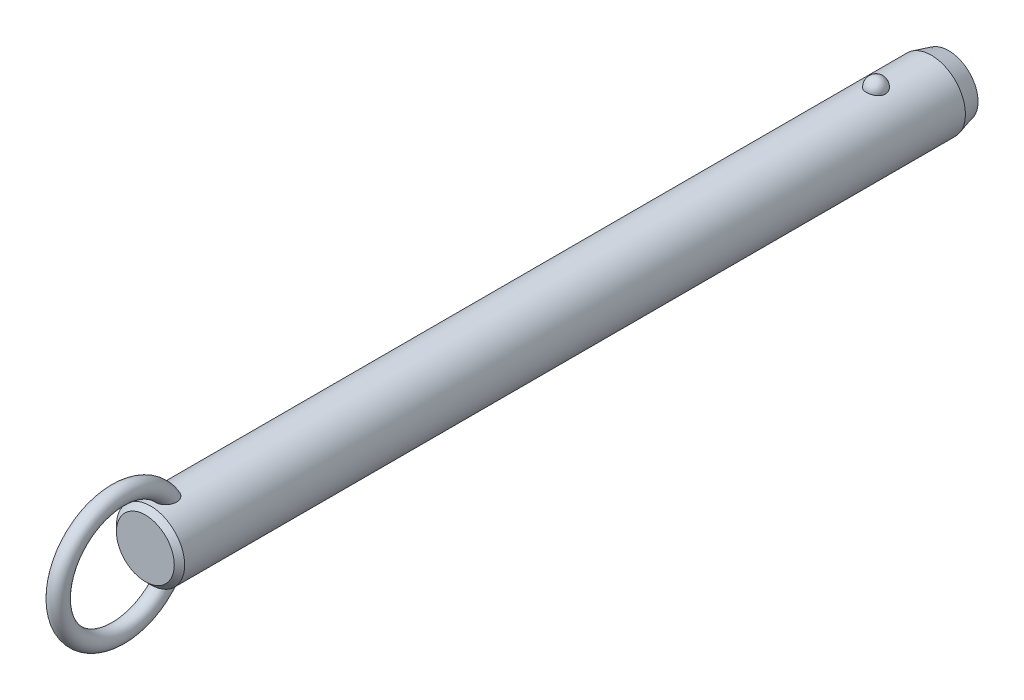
ISO-10303-21;
HEADER;
FILE_DESCRIPTION(('STEP AP214'),'2;1');
FILE_NAME('part.step','',(''),(''),'','','');
FILE_SCHEMA(('AUTOMOTIVE_DESIGN { 1 0 10303 214 1 1 1 1 }'));
ENDSEC;
DATA;
#1=APPLICATION_CONTEXT('core data for automotive mechanical design processes');
#2=APPLICATION_PROTOCOL_DEFINITION('international standard','automotive_design',2000,#1);
#3=PRODUCT_CONTEXT('',#1,'mechanical');
#4=PRODUCT('Part','Part','',(#3));
#5=PRODUCT_RELATED_PRODUCT_CATEGORY('part','',(#4));
#6=PRODUCT_DEFINITION_FORMATION('','',#4);
#7=PRODUCT_DEFINITION_CONTEXT('part definition',#1,'design');
#8=PRODUCT_DEFINITION('design','',#6,#7);
#9=PRODUCT_DEFINITION_SHAPE('','',#8);
#10=(LENGTH_UNIT() NAMED_UNIT(*) SI_UNIT(.MILLI.,.METRE.));
#11=(NAMED_UNIT(*) PLANE_ANGLE_UNIT() SI_UNIT($,.RADIAN.));
#12=(NAMED_UNIT(*) SI_UNIT($,.STERADIAN.) SOLID_ANGLE_UNIT());
#13=UNCERTAINTY_MEASURE_WITH_UNIT(LENGTH_MEASURE(1.E-05),#10,'distance_accuracy_value','');
#14=(GEOMETRIC_REPRESENTATION_CONTEXT(3) GLOBAL_UNCERTAINTY_ASSIGNED_CONTEXT((#13)) GLOBAL_UNIT_ASSIGNED_CONTEXT((#10,
#11,#12)) REPRESENTATION_CONTEXT('',''));
#15=CARTESIAN_POINT('',(0.,0.,0.));
#16=DIRECTION('',(0.,0.,1.));
#17=DIRECTION('',(1.,0.,0.));
#18=AXIS2_PLACEMENT_3D('',#15,#16,#17);
#19=CARTESIAN_POINT('',(0.,0.,157.5));
#20=DIRECTION('',(0.,0.,-1.));
#21=DIRECTION('',(-1.,0.,0.));
#22=AXIS2_PLACEMENT_3D('',#19,#20,#21);
#23=CYLINDRICAL_SURFACE('',#22,7.9);
#24=CARTESIAN_POINT('',(2.1785689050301,7.59367088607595,-2.20000000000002));
#25=CARTESIAN_POINT('',(2.17856679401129,7.59367269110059,-2.07701843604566));
#26=CARTESIAN_POINT('',(2.16853481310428,7.59657145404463,-1.95401006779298));
#27=CARTESIAN_POINT('',(2.12864689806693,7.607843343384,-1.71147811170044));
#28=CARTESIAN_POINT('',(2.09878338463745,7.61621856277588,-1.5919558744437));
#29=CARTESIAN_POINT('',(2.0199931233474,7.63749180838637,-1.35985638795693));
#30=CARTESIAN_POINT('',(1.97107475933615,7.6503878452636,-1.24727610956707));
#31=CARTESIAN_POINT('',(1.85539377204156,7.67926115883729,-1.03213234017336));
#32=CARTESIAN_POINT('',(1.78863158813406,7.69523835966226,-0.929568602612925));
#33=CARTESIAN_POINT('',(1.63856494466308,7.7285848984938,-0.73678633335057));
#34=CARTESIAN_POINT('',(1.55518140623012,7.7459606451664,-0.646630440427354));
#35=CARTESIAN_POINT('',(1.37422937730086,7.78009978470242,-0.481747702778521));
#36=CARTESIAN_POINT('',(1.27666086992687,7.79686317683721,-0.407020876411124));
#37=CARTESIAN_POINT('',(1.07024728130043,7.82786153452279,-0.275278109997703));
#38=CARTESIAN_POINT('',(0.961434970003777,7.84210353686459,-0.218212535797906));
#39=CARTESIAN_POINT('',(0.735351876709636,7.86652194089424,-0.123146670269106));
#40=CARTESIAN_POINT('',(0.618082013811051,7.87669878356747,-0.0851443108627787));
#41=CARTESIAN_POINT('',(0.380637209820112,7.89170521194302,-0.0298158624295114));
#42=CARTESIAN_POINT('',(0.260550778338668,7.89662650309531,-0.0121347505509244));
#43=CARTESIAN_POINT('',(0.0190117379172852,7.90090003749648,0.00324379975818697));
#44=CARTESIAN_POINT('',(-0.102440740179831,7.90025280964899,0.000943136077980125));
#45=CARTESIAN_POINT('',(-0.341452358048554,7.89351056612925,-0.0233955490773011));
#46=CARTESIAN_POINT('',(-0.459042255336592,7.88749257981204,-0.0451545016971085));
#47=CARTESIAN_POINT('',(-0.688796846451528,7.87075812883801,-0.107408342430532));
#48=CARTESIAN_POINT('',(-0.800961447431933,7.86004158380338,-0.14790355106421));
#49=CARTESIAN_POINT('',(-1.01743634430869,7.83497131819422,-0.246799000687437));
#50=CARTESIAN_POINT('',(-1.12169791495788,7.82059709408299,-0.305300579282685));
#51=CARTESIAN_POINT('',(-1.31891765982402,7.78976470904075,-0.43854939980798));
#52=CARTESIAN_POINT('',(-1.41187469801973,7.77330633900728,-0.513298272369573));
#53=CARTESIAN_POINT('',(-1.58577142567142,7.73972434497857,-0.678622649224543));
#54=CARTESIAN_POINT('',(-1.66645140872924,7.72259402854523,-0.769470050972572));
#55=CARTESIAN_POINT('',(-1.81161503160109,7.68983776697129,-0.963538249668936));
#56=CARTESIAN_POINT('',(-1.87609753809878,7.6742119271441,-1.0667599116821));
#57=CARTESIAN_POINT('',(-1.98790138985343,7.6460202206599,-1.28401170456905));
#58=CARTESIAN_POINT('',(-2.03501994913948,7.63349104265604,-1.39815107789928));
#59=CARTESIAN_POINT('',(-2.10986724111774,7.6131449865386,-1.6330178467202));
#60=CARTESIAN_POINT('',(-2.1375965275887,7.60532797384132,-1.75374505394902));
#61=CARTESIAN_POINT('',(-2.17289256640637,7.5953195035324,-1.99782562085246));
#62=CARTESIAN_POINT('',(-2.18054294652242,7.59310471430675,-2.12116592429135));
#63=CARTESIAN_POINT('',(-2.17572919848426,7.59448538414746,-2.36741799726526));
#64=CARTESIAN_POINT('',(-2.1632656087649,7.59808068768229,-2.49032977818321));
#65=CARTESIAN_POINT('',(-2.11865035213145,7.61064035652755,-2.73161015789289));
#66=CARTESIAN_POINT('',(-2.08659579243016,7.61957823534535,-2.84999812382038));
#67=CARTESIAN_POINT('',(-2.00367799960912,7.64179982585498,-3.07955956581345));
#68=CARTESIAN_POINT('',(-1.9528140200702,7.65508371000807,-3.19073275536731));
#69=CARTESIAN_POINT('',(-1.83321113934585,7.68460381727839,-3.40337899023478));
#70=CARTESIAN_POINT('',(-1.76437735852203,7.70085556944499,-3.5047965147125));
#71=CARTESIAN_POINT('',(-1.61069526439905,7.73445734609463,-3.69446912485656));
#72=CARTESIAN_POINT('',(-1.52584634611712,7.75180741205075,-3.78272371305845));
#73=CARTESIAN_POINT('',(-1.34198059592,7.78574608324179,-3.94393987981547));
#74=CARTESIAN_POINT('',(-1.24291308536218,7.80233167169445,-4.01684434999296));
#75=CARTESIAN_POINT('',(-1.03352039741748,7.83281625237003,-4.14489386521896));
#76=CARTESIAN_POINT('',(-0.92319600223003,7.84671543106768,-4.20004014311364));
#77=CARTESIAN_POINT('',(-0.695822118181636,7.87011575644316,-4.29042017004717));
#78=CARTESIAN_POINT('',(-0.578872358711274,7.87966903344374,-4.32589112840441));
#79=CARTESIAN_POINT('',(-0.340410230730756,7.8935652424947,-4.37692226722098));
#80=CARTESIAN_POINT('',(-0.218898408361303,7.89790879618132,-4.39248482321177));
#81=CARTESIAN_POINT('',(0.0228107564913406,7.90087453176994,-4.40314405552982));
#82=CARTESIAN_POINT('',(0.142990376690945,7.89960185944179,-4.39861683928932));
#83=CARTESIAN_POINT('',(0.380829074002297,7.89171262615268,-4.37008293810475));
#84=CARTESIAN_POINT('',(0.498488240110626,7.8850962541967,-4.34607694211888));
#85=CARTESIAN_POINT('',(0.727535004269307,7.86726442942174,-4.27939317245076));
#86=CARTESIAN_POINT('',(0.838944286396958,7.85606616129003,-4.23678512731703));
#87=CARTESIAN_POINT('',(1.05295421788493,7.83025654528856,-4.13408348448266));
#88=CARTESIAN_POINT('',(1.15555431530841,7.81564498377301,-4.07398879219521));
#89=CARTESIAN_POINT('',(1.35076763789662,7.7843022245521,-3.93687432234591));
#90=CARTESIAN_POINT('',(1.4432046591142,7.76754209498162,-3.85961036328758));
#91=CARTESIAN_POINT('',(1.6139111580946,7.73387857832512,-3.69076949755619));
#92=CARTESIAN_POINT('',(1.6921781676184,7.71697516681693,-3.59919010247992));
#93=CARTESIAN_POINT('',(1.83380875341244,7.6845643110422,-3.40247278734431));
#94=CARTESIAN_POINT('',(1.89689280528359,7.66908588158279,-3.29712873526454));
#95=CARTESIAN_POINT('',(2.0047823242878,7.64159441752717,-3.07707931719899));
#96=CARTESIAN_POINT('',(2.0495945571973,7.62958010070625,-2.96237743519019));
#97=CARTESIAN_POINT('',(2.11580183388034,7.61146617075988,-2.74040519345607));
#98=CARTESIAN_POINT('',(2.13929812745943,7.60484503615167,-2.63379846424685));
#99=CARTESIAN_POINT('',(2.17068242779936,7.59594664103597,-2.4181348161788));
#100=CARTESIAN_POINT('',(2.17857077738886,7.59366928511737,-2.30907795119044));
#101=CARTESIAN_POINT('',(2.1785689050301,7.59367088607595,-2.20000000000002));
#102=B_SPLINE_CURVE_WITH_KNOTS('',3,(#24,#25,#26,#27,#28,#29,#30,#31,#32,#33,#34,#35,#36,#37,
#38,#39,#40,#41,#42,#43,#44,#45,#46,#47,#48,#49,#50,#51,#52,#53,#54,#55,#56,#57,#58,#59,#60,#61,
#62,#63,#64,#65,#66,#67,#68,#69,#70,#71,#72,#73,#74,#75,#76,#77,#78,#79,#80,#81,#82,#83,#84,#85,
#86,#87,#88,#89,#90,#91,#92,#93,#94,#95,#96,#97,#98,#99,#100,#101),.UNSPECIFIED.,.T.,.F.,(4,2,2,
2,2,2,2,2,2,2,2,2,2,2,2,2,2,2,2,2,2,2,2,2,2,2,2,2,2,2,2,2,2,2,2,2,2,2,4),(0.,0.368552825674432,
0.737246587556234,1.10577831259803,1.4743009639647,1.8446206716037,2.21494081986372,
2.5842105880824,2.95344028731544,3.31611630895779,3.67875788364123,4.03628044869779,
4.39380913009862,4.75338791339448,5.11300280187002,5.47939989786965,5.8458226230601,
6.21639834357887,6.58696347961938,6.95598276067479,7.32499216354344,7.69218715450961,
8.0593967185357,8.42858578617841,8.79778880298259,9.16834203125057,9.5388695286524,
9.90482699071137,10.2707407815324,10.6298333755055,10.9889132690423,11.3466585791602,
11.7044262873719,12.0676511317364,12.4309391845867,12.8004764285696,13.1698767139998,
13.4967701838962,13.8236564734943),.UNSPECIFIED.);
#103=CARTESIAN_POINT('',(2.1785689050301,7.59367088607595,-2.20000000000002));
#104=VERTEX_POINT('',#103);
#105=EDGE_CURVE('E41',#104,#104,#102,.T.);
#106=ORIENTED_EDGE('',*,*,#105,.T.);
#107=EDGE_LOOP('',(#106));
#108=FACE_BOUND('',#107,.T.);
#109=CARTESIAN_POINT('',(0.,0.,165.82));
#110=DIRECTION('',(0.,0.,1.));
#111=DIRECTION('',(1.,0.,0.));
#112=AXIS2_PLACEMENT_3D('',#109,#110,#111);
#113=CIRCLE('',#112,7.9);
#114=CARTESIAN_POINT('',(7.9,0.,165.82));
#115=VERTEX_POINT('',#114);
#116=EDGE_CURVE('E10',#115,#115,#113,.F.);
#117=ORIENTED_EDGE('',*,*,#116,.T.);
#118=EDGE_LOOP('',(#117));
#119=FACE_BOUND('',#118,.T.);
#120=CARTESIAN_POINT('',(-0.630969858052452,-7.87476203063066,159.712432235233));
#121=CARTESIAN_POINT('',(-0.734180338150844,-7.86648998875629,159.747285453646));
#122=CARTESIAN_POINT('',(-0.834476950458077,-7.85639291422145,159.790816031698));
#123=CARTESIAN_POINT('',(-1.0262035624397,-7.83366343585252,159.894094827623));
#124=CARTESIAN_POINT('',(-1.1176141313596,-7.82102565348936,159.953877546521));
#125=CARTESIAN_POINT('',(-1.28877277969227,-7.79464922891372,160.087839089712));
#126=CARTESIAN_POINT('',(-1.36854014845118,-7.78091246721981,160.161993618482));
#127=CARTESIAN_POINT('',(-1.51461521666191,-7.75380398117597,160.322494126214));
#128=CARTESIAN_POINT('',(-1.58092966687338,-7.74043207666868,160.408833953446));
#129=CARTESIAN_POINT('',(-1.70019064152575,-7.7151252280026,160.592978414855));
#130=CARTESIAN_POINT('',(-1.75284037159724,-7.70322473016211,160.690979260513));
#131=CARTESIAN_POINT('',(-1.84263464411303,-7.68224112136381,160.894102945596));
#132=CARTESIAN_POINT('',(-1.87977299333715,-7.6731591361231,160.999228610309));
#133=CARTESIAN_POINT('',(-1.94152728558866,-7.65777930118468,161.223284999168));
#134=CARTESIAN_POINT('',(-1.96475471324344,-7.65179654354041,161.342616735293));
#135=CARTESIAN_POINT('',(-1.99449499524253,-7.64409642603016,161.58342986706));
#136=CARTESIAN_POINT('',(-2.0010005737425,-7.64238092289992,161.704912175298));
#137=CARTESIAN_POINT('',(-1.99856014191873,-7.64302120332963,161.968340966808));
#138=CARTESIAN_POINT('',(-1.98680021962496,-7.64611845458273,162.11025654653));
#139=CARTESIAN_POINT('',(-1.94457772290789,-7.65696186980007,162.391118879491));
#140=CARTESIAN_POINT('',(-1.91409393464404,-7.66471330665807,162.530062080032));
#141=CARTESIAN_POINT('',(-1.82768670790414,-7.68582947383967,162.831939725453));
#142=CARTESIAN_POINT('',(-1.76772963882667,-7.70003779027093,162.993686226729));
#143=CARTESIAN_POINT('',(-1.65998501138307,-7.72371550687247,163.227695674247));
#144=CARTESIAN_POINT('',(-1.621079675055,-7.73200670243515,163.304297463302));
#145=CARTESIAN_POINT('',(-1.53727726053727,-7.74910377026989,163.454079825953));
#146=CARTESIAN_POINT('',(-1.49238215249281,-7.75790947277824,163.527261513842));
#147=CARTESIAN_POINT('',(-1.37397050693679,-7.77993338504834,163.70288382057));
#148=CARTESIAN_POINT('',(-1.29690364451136,-7.79328473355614,163.802955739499));
#149=CARTESIAN_POINT('',(-1.1288548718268,-7.81939266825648,163.990714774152));
#150=CARTESIAN_POINT('',(-1.0378992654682,-7.83215032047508,164.078424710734));
#151=CARTESIAN_POINT('',(-0.86953281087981,-7.85231710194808,164.213414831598));
#152=CARTESIAN_POINT('',(-0.795716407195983,-7.86021093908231,164.265076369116));
#153=CARTESIAN_POINT('',(-0.640813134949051,-7.87434920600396,164.356381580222));
#154=CARTESIAN_POINT('',(-0.559737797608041,-7.88059619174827,164.39604389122));
#155=CARTESIAN_POINT('',(-0.406456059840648,-7.88984116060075,164.454300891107));
#156=CARTESIAN_POINT('',(-0.335227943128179,-7.89321892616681,164.475384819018));
#157=CARTESIAN_POINT('',(-0.190193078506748,-7.89804235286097,164.50541418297));
#158=CARTESIAN_POINT('',(-0.11638863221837,-7.89948969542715,164.514370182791));
#159=CARTESIAN_POINT('',(0.0318414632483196,-7.90028409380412,164.519291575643));
#160=CARTESIAN_POINT('',(0.106268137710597,-7.89962640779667,164.515227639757));
#161=CARTESIAN_POINT('',(0.253290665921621,-7.8962818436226,164.494461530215));
#162=CARTESIAN_POINT('',(0.325885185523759,-7.8935935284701,164.477750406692));
#163=CARTESIAN_POINT('',(0.481441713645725,-7.88577340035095,164.428738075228));
#164=CARTESIAN_POINT('',(0.563611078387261,-7.88026321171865,164.394005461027));
#165=CARTESIAN_POINT('',(0.721129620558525,-7.86741729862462,164.311796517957));
#166=CARTESIAN_POINT('',(0.796466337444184,-7.86007832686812,164.264297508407));
#167=CARTESIAN_POINT('',(0.971456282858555,-7.84073285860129,164.136513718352));
#168=CARTESIAN_POINT('',(1.06719686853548,-7.82809461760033,164.051004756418));
#169=CARTESIAN_POINT('',(1.24418921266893,-7.80192439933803,163.866232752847));
#170=CARTESIAN_POINT('',(1.32540832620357,-7.78839049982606,163.766939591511));
#171=CARTESIAN_POINT('',(1.45199971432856,-7.76559693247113,163.589576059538));
#172=CARTESIAN_POINT('',(1.50085649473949,-7.75626094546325,163.513954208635));
#173=CARTESIAN_POINT('',(1.59197749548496,-7.7380727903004,163.358742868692));
#174=CARTESIAN_POINT('',(1.63423919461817,-7.72922080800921,163.279151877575));
#175=CARTESIAN_POINT('',(1.71222612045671,-7.71231959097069,163.116664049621));
#176=CARTESIAN_POINT('',(1.74794516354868,-7.70427111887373,163.033764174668));
#177=CARTESIAN_POINT('',(1.81270113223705,-7.68929240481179,162.8652967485));
#178=CARTESIAN_POINT('',(1.84173789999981,-7.68236218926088,162.779729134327));
#179=CARTESIAN_POINT('',(1.89322698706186,-7.6698375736,162.60528702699));
#180=CARTESIAN_POINT('',(1.91558744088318,-7.66426199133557,162.516383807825));
#181=CARTESIAN_POINT('',(1.95281367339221,-7.65485915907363,162.336969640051));
#182=CARTESIAN_POINT('',(1.96767946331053,-7.65103190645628,162.246458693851));
#183=CARTESIAN_POINT('',(2.00021456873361,-7.64262981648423,161.973732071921));
#184=CARTESIAN_POINT('',(2.00600691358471,-7.6410871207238,161.789709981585));
#185=CARTESIAN_POINT('',(1.98445334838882,-7.64669564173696,161.476501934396));
#186=CARTESIAN_POINT('',(1.96607186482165,-7.65149688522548,161.346618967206));
#187=CARTESIAN_POINT('',(1.90884967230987,-7.6659762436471,161.091632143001));
#188=CARTESIAN_POINT('',(1.87002101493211,-7.67565148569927,160.966525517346));
#189=CARTESIAN_POINT('',(1.77063986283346,-7.69918471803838,160.72454013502));
#190=CARTESIAN_POINT('',(1.70993724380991,-7.71307150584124,160.607725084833));
#191=CARTESIAN_POINT('',(1.56733070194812,-7.74330306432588,160.388144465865));
#192=CARTESIAN_POINT('',(1.48543692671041,-7.75964665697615,160.285372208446));
#193=CARTESIAN_POINT('',(1.31346177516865,-7.79047523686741,160.109380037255));
#194=CARTESIAN_POINT('',(1.22547278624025,-7.80495298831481,160.034106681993));
#195=CARTESIAN_POINT('',(1.03724352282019,-7.83218597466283,159.900486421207));
#196=CARTESIAN_POINT('',(0.937008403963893,-7.84494192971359,159.842132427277));
#197=CARTESIAN_POINT('',(0.733599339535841,-7.86649045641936,159.747027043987));
#198=CARTESIAN_POINT('',(0.630941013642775,-7.87547134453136,159.709210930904));
#199=CARTESIAN_POINT('',(0.420465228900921,-7.88950708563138,159.651116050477));
#200=CARTESIAN_POINT('',(0.312645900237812,-7.89456050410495,159.63084369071));
#201=CARTESIAN_POINT('',(0.0960869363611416,-7.9001518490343,159.608455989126));
#202=CARTESIAN_POINT('',(-0.012634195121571,-7.90073226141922,159.606169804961));
#203=CARTESIAN_POINT('',(-0.228766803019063,-7.89742350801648,159.619367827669));
#204=CARTESIAN_POINT('',(-0.336180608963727,-7.89354403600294,159.634813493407));
#205=CARTESIAN_POINT('',(-0.473410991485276,-7.88586871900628,159.666217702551));
#206=CARTESIAN_POINT('',(-0.505257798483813,-7.88388984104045,159.674354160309));
#207=CARTESIAN_POINT('',(-0.568481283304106,-7.87958326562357,159.692208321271));
#208=CARTESIAN_POINT('',(-0.599857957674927,-7.87725556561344,159.701926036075));
#209=CARTESIAN_POINT('',(-0.630969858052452,-7.87476203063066,159.712432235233));
#210=B_SPLINE_CURVE_WITH_KNOTS('',3,(#120,#121,#122,#123,#124,#125,#126,#127,#128,#129,#130,
#131,#132,#133,#134,#135,#136,#137,#138,#139,#140,#141,#142,#143,#144,#145,#146,#147,#148,#149,
#150,#151,#152,#153,#154,#155,#156,#157,#158,#159,#160,#161,#162,#163,#164,#165,#166,#167,#168,
#169,#170,#171,#172,#173,#174,#175,#176,#177,#178,#179,#180,#181,#182,#183,#184,#185,#186,#187,
#188,#189,#190,#191,#192,#193,#194,#195,#196,#197,#198,#199,#200,#201,#202,#203,#204,#205,#206,
#207,#208,#209),.UNSPECIFIED.,.T.,.F.,(4,2,2,2,2,2,2,2,2,2,2,2,2,2,2,2,2,2,2,2,2,2,2,2,2,2,2,2,
2,2,2,2,2,2,2,2,2,2,2,2,2,2,2,2,4),(0.,0.327622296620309,0.655945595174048,0.983718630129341,
1.3113267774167,1.64554655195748,1.97989964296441,2.34365728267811,2.70757317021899,
3.13333684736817,3.55958380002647,4.07655306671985,4.33527897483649,4.59391999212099,
4.97382437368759,5.353017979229,5.62348245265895,5.89352465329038,6.11565959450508,
6.33760092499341,6.56004255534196,6.78264174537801,7.0493084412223,7.31645206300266,
7.70130871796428,8.08701995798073,8.35824509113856,8.62957365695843,8.90115735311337,
9.1727474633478,9.44791855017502,9.72308922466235,10.2715298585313,10.6638393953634,
11.0559179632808,11.4507403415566,11.8453740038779,12.1936425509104,12.5417649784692,
12.8695063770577,13.1973674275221,13.5221104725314,13.8461490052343,13.9449071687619,
14.0436660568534),.UNSPECIFIED.);
#211=CARTESIAN_POINT('',(-0.630969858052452,-7.87476203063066,159.712432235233));
#212=VERTEX_POINT('',#211);
#213=EDGE_CURVE('E60',#212,#212,#210,.T.);
#214=ORIENTED_EDGE('',*,*,#213,.T.);
#215=EDGE_LOOP('',(#214));
#216=FACE_BOUND('',#215,.T.);
#217=CARTESIAN_POINT('',(-0.630969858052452,7.87476203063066,159.712432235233));
#218=CARTESIAN_POINT('',(-0.52891882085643,7.88293636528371,159.677979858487));
#219=CARTESIAN_POINT('',(-0.423745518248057,7.88934810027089,159.651915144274));
#220=CARTESIAN_POINT('',(-0.210236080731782,7.8979273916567,159.617282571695));
#221=CARTESIAN_POINT('',(-0.101893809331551,7.90008607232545,159.608751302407));
#222=CARTESIAN_POINT('',(0.11466056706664,7.89990877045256,159.609457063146));
#223=CARTESIAN_POINT('',(0.222872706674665,7.89757640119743,159.61867980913));
#224=CARTESIAN_POINT('',(0.436107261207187,7.88867538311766,159.654652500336));
#225=CARTESIAN_POINT('',(0.541131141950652,7.8821087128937,159.68139425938));
#226=CARTESIAN_POINT('',(0.745085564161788,7.86545130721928,159.751756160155));
#227=CARTESIAN_POINT('',(0.844015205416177,7.85536005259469,159.795378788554));
#228=CARTESIAN_POINT('',(1.03299167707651,7.83275153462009,159.898379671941));
#229=CARTESIAN_POINT('',(1.12303841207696,7.8202342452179,159.957758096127));
#230=CARTESIAN_POINT('',(1.29214734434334,7.79408219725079,160.090864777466));
#231=CARTESIAN_POINT('',(1.37116907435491,7.78044359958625,160.164643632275));
#232=CARTESIAN_POINT('',(1.51597677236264,7.75353170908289,160.324235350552));
#233=CARTESIAN_POINT('',(1.58176261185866,7.74025841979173,160.410048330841));
#234=CARTESIAN_POINT('',(1.70057386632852,7.71504069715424,160.593644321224));
#235=CARTESIAN_POINT('',(1.75320073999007,7.7031425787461,160.691690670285));
#236=CARTESIAN_POINT('',(1.8429376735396,7.68216822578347,160.894893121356));
#237=CARTESIAN_POINT('',(1.88004278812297,7.67309289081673,161.000051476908));
#238=CARTESIAN_POINT('',(1.9417232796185,7.6577294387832,161.224167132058));
#239=CARTESIAN_POINT('',(1.96491037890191,7.65175648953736,161.343524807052));
#240=CARTESIAN_POINT('',(1.9945689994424,7.64407702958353,161.584384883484));
#241=CARTESIAN_POINT('',(2.00103304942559,7.64237242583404,161.70588821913));
#242=CARTESIAN_POINT('',(1.99850166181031,7.64303650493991,161.969368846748));
#243=CARTESIAN_POINT('',(1.98669038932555,7.64614714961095,162.111314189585));
#244=CARTESIAN_POINT('',(1.94436120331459,7.6570170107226,162.392228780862));
#245=CARTESIAN_POINT('',(1.91382203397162,7.66478150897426,162.531194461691));
#246=CARTESIAN_POINT('',(1.82728754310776,7.68592483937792,162.833111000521));
#247=CARTESIAN_POINT('',(1.76725778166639,7.7001468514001,162.994872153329));
#248=CARTESIAN_POINT('',(1.65939700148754,7.72384204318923,163.228891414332));
#249=CARTESIAN_POINT('',(1.62045187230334,7.73213852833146,163.305494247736));
#250=CARTESIAN_POINT('',(1.53656684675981,7.74924489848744,163.455273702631));
#251=CARTESIAN_POINT('',(1.49162892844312,7.75805461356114,163.528451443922));
#252=CARTESIAN_POINT('',(1.37317698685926,7.78007342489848,163.703952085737));
#253=CARTESIAN_POINT('',(1.29612360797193,7.79341423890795,163.803911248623));
#254=CARTESIAN_POINT('',(1.12812043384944,7.81949839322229,163.99145083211));
#255=CARTESIAN_POINT('',(1.03719688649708,7.83224280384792,164.079054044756));
#256=CARTESIAN_POINT('',(0.868871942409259,7.85239026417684,164.21389715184));
#257=CARTESIAN_POINT('',(0.795056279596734,7.86027769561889,164.265511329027));
#258=CARTESIAN_POINT('',(0.640160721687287,7.87440222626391,164.356720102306));
#259=CARTESIAN_POINT('',(0.559092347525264,7.88064188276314,164.396333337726));
#260=CARTESIAN_POINT('',(0.405820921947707,7.8898738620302,164.454505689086));
#261=CARTESIAN_POINT('',(0.334594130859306,7.89324577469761,164.475552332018));
#262=CARTESIAN_POINT('',(0.189568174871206,7.89805733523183,164.505507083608));
#263=CARTESIAN_POINT('',(0.115771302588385,7.89949866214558,164.514425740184));
#264=CARTESIAN_POINT('',(-0.0324359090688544,7.90028156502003,164.51927589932));
#265=CARTESIAN_POINT('',(-0.106847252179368,7.89961843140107,164.515178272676));
#266=CARTESIAN_POINT('',(-0.253834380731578,7.8962642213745,164.494351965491));
#267=CARTESIAN_POINT('',(-0.326408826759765,7.89357170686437,164.477614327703));
#268=CARTESIAN_POINT('',(-0.481962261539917,7.88574179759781,164.428539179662));
#269=CARTESIAN_POINT('',(-0.564145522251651,7.88022507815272,164.393763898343));
#270=CARTESIAN_POINT('',(-0.7216852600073,7.86736646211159,164.311468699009));
#271=CARTESIAN_POINT('',(-0.797029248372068,7.8600213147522,164.263926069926));
#272=CARTESIAN_POINT('',(-0.972044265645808,7.84066026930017,164.136026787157));
#273=CARTESIAN_POINT('',(-1.06779803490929,7.828012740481,164.050443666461));
#274=CARTESIAN_POINT('',(-1.24480531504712,7.80182621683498,163.865522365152));
#275=CARTESIAN_POINT('',(-1.32602618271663,7.78828530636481,163.766154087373));
#276=CARTESIAN_POINT('',(-1.4525983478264,7.76548487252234,163.588680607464));
#277=CARTESIAN_POINT('',(-1.50143856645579,7.75614818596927,163.513025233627));
#278=CARTESIAN_POINT('',(-1.59252410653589,7.73796020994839,163.357748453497));
#279=CARTESIAN_POINT('',(-1.63476690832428,7.729109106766,163.278125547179));
#280=CARTESIAN_POINT('',(-1.7127131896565,7.71221133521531,163.115575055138));
#281=CARTESIAN_POINT('',(-1.74841047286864,7.70416543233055,163.032644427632));
#282=CARTESIAN_POINT('',(-1.81311929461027,7.6891937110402,162.864116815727));
#283=CARTESIAN_POINT('',(-1.84213067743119,7.68226791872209,162.778519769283));
#284=CARTESIAN_POINT('',(-1.89356259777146,7.66975461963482,162.604025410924));
#285=CARTESIAN_POINT('',(-1.91589165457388,7.66418586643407,162.515099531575));
#286=CARTESIAN_POINT('',(-1.9530507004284,7.65479859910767,162.335642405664));
#287=CARTESIAN_POINT('',(-1.96788069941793,7.65098008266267,162.245111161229));
#288=CARTESIAN_POINT('',(-2.00030078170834,7.64260704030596,161.972327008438));
#289=CARTESIAN_POINT('',(-2.00600576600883,7.64108760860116,161.788271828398));
#290=CARTESIAN_POINT('',(-1.9842848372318,7.64673945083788,161.475080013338));
#291=CARTESIAN_POINT('',(-1.96583698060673,7.65155751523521,161.345240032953));
#292=CARTESIAN_POINT('',(-1.90848948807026,7.66606613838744,161.090361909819));
#293=CARTESIAN_POINT('',(-1.86960376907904,7.67575338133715,160.965320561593));
#294=CARTESIAN_POINT('',(-1.77013421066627,7.6993013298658,160.723500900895));
#295=CARTESIAN_POINT('',(-1.70940488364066,7.71318991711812,160.606784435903));
#296=CARTESIAN_POINT('',(-1.5667295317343,7.74342495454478,160.387340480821));
#297=CARTESIAN_POINT('',(-1.48478316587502,7.75977144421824,160.28461321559));
#298=CARTESIAN_POINT('',(-1.31266325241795,7.79061163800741,160.108643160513));
#299=CARTESIAN_POINT('',(-1.22456383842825,7.80509908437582,160.033358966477));
#300=CARTESIAN_POINT('',(-1.03622400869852,7.83231881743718,159.899865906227));
#301=CARTESIAN_POINT('',(-0.936015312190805,7.84505551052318,159.841613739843));
#302=CARTESIAN_POINT('',(-0.798824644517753,7.85957802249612,159.777540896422));
#303=CARTESIAN_POINT('',(-0.765787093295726,7.86286821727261,159.763224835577));
#304=CARTESIAN_POINT('',(-0.698939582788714,7.86909211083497,159.736436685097));
#305=CARTESIAN_POINT('',(-0.665129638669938,7.8720258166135,159.723964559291));
#306=CARTESIAN_POINT('',(-0.630969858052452,7.87476203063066,159.712432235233));
#307=B_SPLINE_CURVE_WITH_KNOTS('',3,(#217,#218,#219,#220,#221,#222,#223,#224,#225,#226,#227,
#228,#229,#230,#231,#232,#233,#234,#235,#236,#237,#238,#239,#240,#241,#242,#243,#244,#245,#246,
#247,#248,#249,#250,#251,#252,#253,#254,#255,#256,#257,#258,#259,#260,#261,#262,#263,#264,#265,
#266,#267,#268,#269,#270,#271,#272,#273,#274,#275,#276,#277,#278,#279,#280,#281,#282,#283,#284,
#285,#286,#287,#288,#289,#290,#291,#292,#293,#294,#295,#296,#297,#298,#299,#300,#301,#302,#303,
#304,#305,#306),.UNSPECIFIED.,.T.,.F.,(4,2,2,2,2,2,2,2,2,2,2,2,2,2,2,2,2,2,2,2,2,2,2,2,2,2,2,2,
2,2,2,2,2,2,2,2,2,2,2,2,2,2,2,2,4),(0.,0.32392037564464,0.648516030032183,0.972850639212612,
1.29703380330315,1.62126473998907,1.94549915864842,2.27089401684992,2.59629203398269,
2.93059633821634,3.26500707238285,3.6288164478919,3.99278833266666,4.41865421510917,
4.84500434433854,5.36209210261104,5.62087589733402,5.87957448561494,6.25918598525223,
6.63808782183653,6.90846748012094,7.17842501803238,7.40052350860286,7.6224287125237,
7.84483086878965,8.0673907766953,8.33414615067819,8.60137921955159,8.98641454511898,
9.37230415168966,9.64358673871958,9.91497268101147,10.1866142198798,10.4582620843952,
10.7334745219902,11.008686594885,11.5572126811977,11.9494246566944,12.3413699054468,
12.7359755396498,13.1305875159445,13.4791770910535,13.82687259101,13.9353013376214,
14.0437279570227),.UNSPECIFIED.);
#308=CARTESIAN_POINT('',(-0.630969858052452,7.87476203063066,159.712432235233));
#309=VERTEX_POINT('',#308);
#310=EDGE_CURVE('E67',#309,#309,#307,.T.);
#311=ORIENTED_EDGE('',*,*,#310,.T.);
#312=EDGE_LOOP('',(#311));
#313=FACE_BOUND('',#312,.T.);
#314=CARTESIAN_POINT('',(0.,0.,-14.9999999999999));
#315=DIRECTION('',(0.,0.,-1.));
#316=DIRECTION('',(-1.,0.,0.));
#317=AXIS2_PLACEMENT_3D('',#314,#315,#316);
#318=CIRCLE('',#317,7.9);
#319=CARTESIAN_POINT('',(-7.9,0.,-14.9999999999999));
#320=VERTEX_POINT('',#319);
#321=EDGE_CURVE('E57',#320,#320,#318,.F.);
#322=ORIENTED_EDGE('',*,*,#321,.T.);
#323=EDGE_LOOP('',(#322));
#324=FACE_BOUND('',#323,.T.);
#325=ADVANCED_FACE('F37',(#108,#119,#216,#313,#324),#23,.T.);
#326=CARTESIAN_POINT('',(0.,0.,-19.));
#327=DIRECTION('',(0.,0.,-1.));
#328=DIRECTION('',(-1.,0.,0.));
#329=AXIS2_PLACEMENT_3D('',#326,#327,#328);
#330=PLANE('',#329);
#331=CARTESIAN_POINT('',(0.,0.,-19.));
#332=DIRECTION('',(0.,0.,-1.));
#333=DIRECTION('',(-1.,0.,0.));
#334=AXIS2_PLACEMENT_3D('',#331,#332,#333);
#335=CIRCLE('',#334,6.8282032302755);
#336=CARTESIAN_POINT('',(-6.8282032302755,0.,-19.));
#337=VERTEX_POINT('',#336);
#338=EDGE_CURVE('E66',#337,#337,#335,.T.);
#339=ORIENTED_EDGE('',*,*,#338,.T.);
#340=EDGE_LOOP('',(#339));
#341=FACE_BOUND('',#340,.T.);
#342=ADVANCED_FACE('F85',(#341),#330,.T.);
#343=CARTESIAN_POINT('',(0.,0.,-19.));
#344=DIRECTION('',(0.,0.,1.));
#345=DIRECTION('',(1.,0.,0.));
#346=AXIS2_PLACEMENT_3D('',#343,#344,#345);
#347=CONICAL_SURFACE('',#346,6.8282032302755,0.261799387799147);
#348=ORIENTED_EDGE('',*,*,#321,.F.);
#349=EDGE_LOOP('',(#348));
#350=FACE_BOUND('',#349,.T.);
#351=ORIENTED_EDGE('',*,*,#338,.F.);
#352=EDGE_LOOP('',(#351));
#353=FACE_BOUND('',#352,.T.);
#354=ADVANCED_FACE('F83',(#350,#353),#347,.T.);
#355=CARTESIAN_POINT('',(0.,0.,167.02));
#356=DIRECTION('',(0.,0.,1.));
#357=DIRECTION('',(1.,0.,0.));
#358=AXIS2_PLACEMENT_3D('',#355,#356,#357);
#359=PLANE('',#358);
#360=CARTESIAN_POINT('',(0.,0.,167.02));
#361=DIRECTION('',(0.,0.,1.));
#362=DIRECTION('',(1.,0.,0.));
#363=AXIS2_PLACEMENT_3D('',#360,#361,#362);
#364=CIRCLE('',#363,6.70000000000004);
#365=CARTESIAN_POINT('',(6.70000000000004,0.,167.02));
#366=VERTEX_POINT('',#365);
#367=EDGE_CURVE('E50',#366,#366,#364,.T.);
#368=ORIENTED_EDGE('',*,*,#367,.T.);
#369=EDGE_LOOP('',(#368));
#370=FACE_BOUND('',#369,.T.);
#371=ADVANCED_FACE('F77',(#370),#359,.T.);
#372=CARTESIAN_POINT('',(0.,0.,173.35));
#373=DIRECTION('',(1.,0.,0.));
#374=DIRECTION('',(0.,0.,-1.));
#375=AXIS2_PLACEMENT_3D('',#372,#373,#374);
#376=TOROIDAL_SURFACE('',#375,13.85,2.);
#377=ORIENTED_EDGE('',*,*,#310,.F.);
#378=EDGE_LOOP('',(#377));
#379=FACE_BOUND('',#378,.T.);
#380=ORIENTED_EDGE('',*,*,#213,.F.);
#381=EDGE_LOOP('',(#380));
#382=FACE_BOUND('',#381,.T.);
#383=ADVANCED_FACE('F73',(#379,#382),#376,.T.);
#384=CARTESIAN_POINT('',(0.,0.,167.02));
#385=DIRECTION('',(0.,0.,-1.));
#386=DIRECTION('',(-1.,0.,0.));
#387=AXIS2_PLACEMENT_3D('',#384,#385,#386);
#388=CONICAL_SURFACE('',#387,6.70000000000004,0.785398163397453);
#389=ORIENTED_EDGE('',*,*,#116,.F.);
#390=EDGE_LOOP('',(#389));
#391=FACE_BOUND('',#390,.T.);
#392=ORIENTED_EDGE('',*,*,#367,.F.);
#393=EDGE_LOOP('',(#392));
#394=FACE_BOUND('',#393,.T.);
#395=ADVANCED_FACE('F39',(#391,#394),#388,.T.);
#396=CARTESIAN_POINT('',(0.,7.9,-2.20000000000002));
#397=DIRECTION('',(0.,1.,0.));
#398=DIRECTION('',(0.,0.,-1.));
#399=AXIS2_PLACEMENT_3D('',#396,#397,#398);
#400=SPHERICAL_SURFACE('',#399,2.2);
#401=ORIENTED_EDGE('',*,*,#105,.F.);
#402=EDGE_LOOP('',(#401));
#403=FACE_BOUND('',#402,.T.);
#404=ADVANCED_FACE('F79',(#403),#400,.T.);
#405=CLOSED_SHELL('',(#325,#342,#354,#371,#383,#395,#404));
#406=MANIFOLD_SOLID_BREP('B2',#405);
#407=ADVANCED_BREP_SHAPE_REPRESENTATION('',(#18,#406),#14);
#408=SHAPE_DEFINITION_REPRESENTATION(#9,#407);
ENDSEC;
END-ISO-10303-21;
